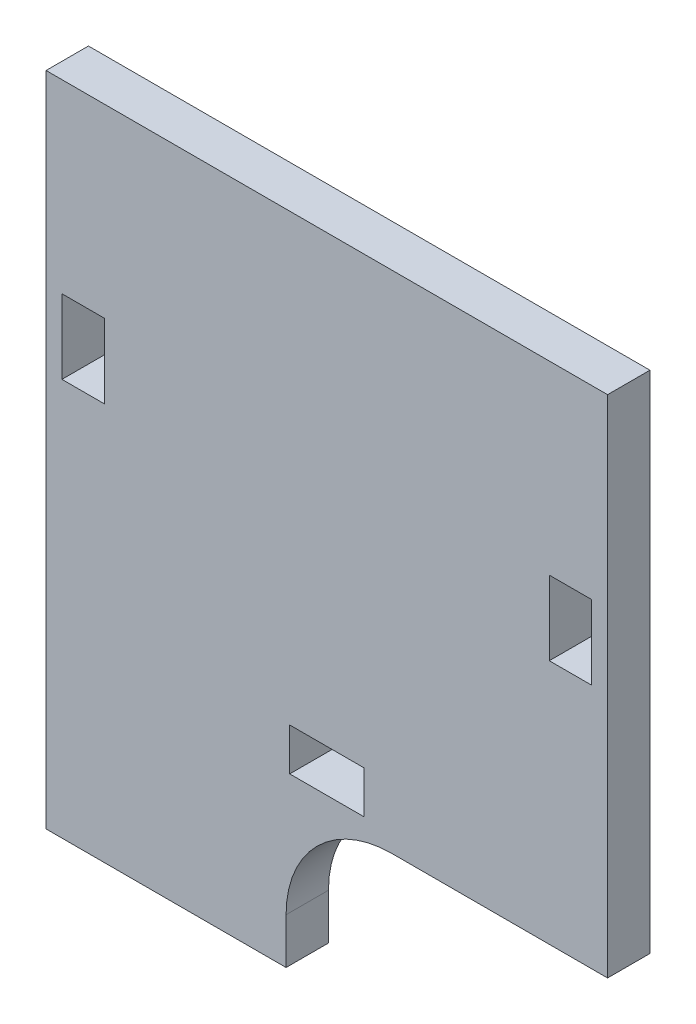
from build123d import *

# Parameters (mm, degrees)
SKETCH1_W           = 4
SKETCH1_H           = 7
SKETCH1_W_2         = 7
SKETCH1_H_2         = 4
BOSS_EXTRUDE3_DEPTH = 4
SKETCH2_W           = 30.732527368
SKETCH2_H           = 14.5
CUT_EXTRUDE1_DEPTH  = 10
FILLET1_R           = 10


with BuildPart() as part:
    # Sketch1 → Boss-Extrude3 (new body)
    with BuildSketch(Plane.XY):
        Polygon((-0.298886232, -55.36470609), (-0.298886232, -55.361213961), (-7.798886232, -55.361213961), (-7.798886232, -55.36470609), (-30.548886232, -55.36470609), (-30.548886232, 6.63529391), (22.451113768, 6.63529391), (22.451113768, -55.36470609), align=None)
        with Locations((18.951113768, -14.36470609)):
            Rectangle(SKETCH1_W, SKETCH1_H, mode=Mode.SUBTRACT)
        with Locations((-27.048886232, -14.36470609)):
            Rectangle(SKETCH1_W, SKETCH1_H, mode=Mode.SUBTRACT)
        with Locations((-4.048886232, -37.36470609)):
            Rectangle(SKETCH1_W_2, SKETCH1_H_2, mode=Mode.SUBTRACT)
    extrude(amount=BOSS_EXTRUDE3_DEPTH)

    # Sketch2 → Cut-Extrude1 (cut)
    with BuildSketch(Plane.XY.offset(4)):
        with Locations((7.472557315, -48.29825366)):
            Rectangle(SKETCH2_W, SKETCH2_H)
    extrude(amount=-CUT_EXTRUDE1_DEPTH, mode=Mode.SUBTRACT)

    # Fillet1
    fillet1_edges = [part.edges().sort_by_distance(p)[0] for p in [
        (-7.893706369, -41.04825366, 2),
    ]]
    fillet(fillet1_edges, radius=FILLET1_R)


solid = part.part
